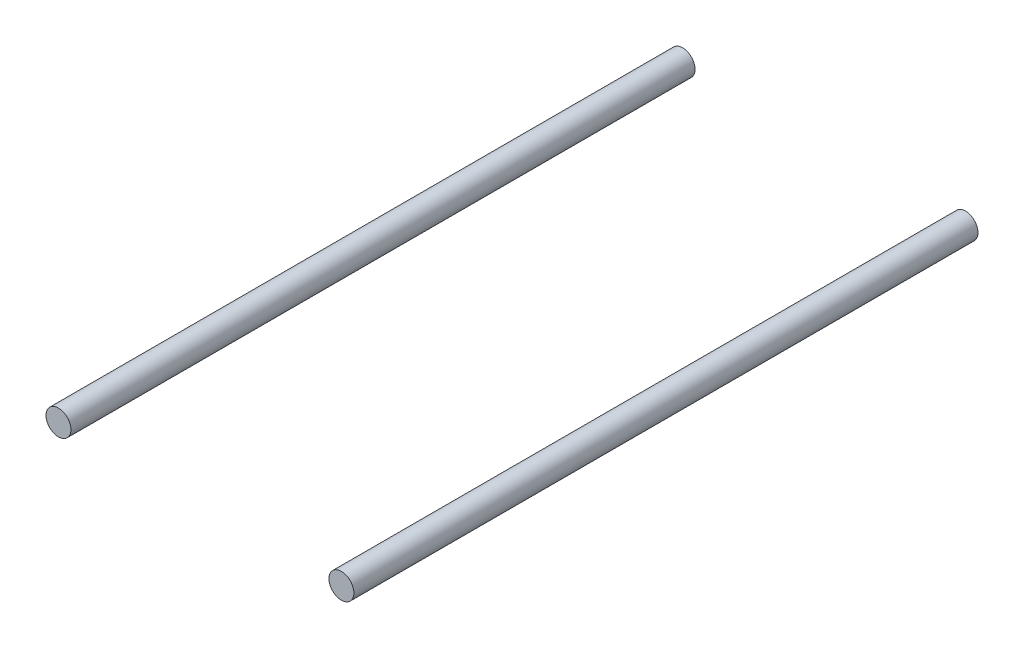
ISO-10303-21;
HEADER;
FILE_DESCRIPTION(('STEP AP214'),'2;1');
FILE_NAME('part.step','',(''),(''),'','','');
FILE_SCHEMA(('AUTOMOTIVE_DESIGN { 1 0 10303 214 1 1 1 1 }'));
ENDSEC;
DATA;
#1=APPLICATION_CONTEXT('core data for automotive mechanical design processes');
#2=APPLICATION_PROTOCOL_DEFINITION('international standard','automotive_design',2000,#1);
#3=PRODUCT_CONTEXT('',#1,'mechanical');
#4=PRODUCT('Part','Part','',(#3));
#5=PRODUCT_RELATED_PRODUCT_CATEGORY('part','',(#4));
#6=PRODUCT_DEFINITION_FORMATION('','',#4);
#7=PRODUCT_DEFINITION_CONTEXT('part definition',#1,'design');
#8=PRODUCT_DEFINITION('design','',#6,#7);
#9=PRODUCT_DEFINITION_SHAPE('','',#8);
#10=(LENGTH_UNIT() NAMED_UNIT(*) SI_UNIT(.MILLI.,.METRE.));
#11=(NAMED_UNIT(*) PLANE_ANGLE_UNIT() SI_UNIT($,.RADIAN.));
#12=(NAMED_UNIT(*) SI_UNIT($,.STERADIAN.) SOLID_ANGLE_UNIT());
#13=UNCERTAINTY_MEASURE_WITH_UNIT(LENGTH_MEASURE(1.E-05),#10,'distance_accuracy_value','');
#14=(GEOMETRIC_REPRESENTATION_CONTEXT(3) GLOBAL_UNCERTAINTY_ASSIGNED_CONTEXT((#13)) GLOBAL_UNIT_ASSIGNED_CONTEXT((#10,
#11,#12)) REPRESENTATION_CONTEXT('',''));
#15=CARTESIAN_POINT('',(0.,0.,0.));
#16=DIRECTION('',(0.,0.,1.));
#17=DIRECTION('',(1.,0.,0.));
#18=AXIS2_PLACEMENT_3D('',#15,#16,#17);
#19=CARTESIAN_POINT('',(42.,7.5,-65.));
#20=DIRECTION('',(0.,0.,1.));
#21=DIRECTION('',(1.,0.,0.));
#22=AXIS2_PLACEMENT_3D('',#19,#20,#21);
#23=CYLINDRICAL_SURFACE('',#22,1.5);
#24=CARTESIAN_POINT('',(42.,7.5,-65.));
#25=DIRECTION('',(0.,0.,1.));
#26=DIRECTION('',(1.,0.,0.));
#27=AXIS2_PLACEMENT_3D('',#24,#25,#26);
#28=CIRCLE('',#27,1.5);
#29=CARTESIAN_POINT('',(43.5,7.5,-65.));
#30=VERTEX_POINT('',#29);
#31=EDGE_CURVE('E11',#30,#30,#28,.T.);
#32=ORIENTED_EDGE('',*,*,#31,.T.);
#33=EDGE_LOOP('',(#32));
#34=FACE_BOUND('',#33,.T.);
#35=CARTESIAN_POINT('',(42.,7.5,10.));
#36=DIRECTION('',(0.,0.,1.));
#37=DIRECTION('',(1.,0.,0.));
#38=AXIS2_PLACEMENT_3D('',#35,#36,#37);
#39=CIRCLE('',#38,1.5);
#40=CARTESIAN_POINT('',(43.5,7.5,10.));
#41=VERTEX_POINT('',#40);
#42=EDGE_CURVE('E42',#41,#41,#39,.T.);
#43=ORIENTED_EDGE('',*,*,#42,.F.);
#44=EDGE_LOOP('',(#43));
#45=FACE_BOUND('',#44,.T.);
#46=ADVANCED_FACE('F36',(#34,#45),#23,.T.);
#47=CARTESIAN_POINT('',(42.,7.5,-65.));
#48=DIRECTION('',(0.,0.,1.));
#49=DIRECTION('',(1.,0.,0.));
#50=AXIS2_PLACEMENT_3D('',#47,#48,#49);
#51=PLANE('',#50);
#52=ORIENTED_EDGE('',*,*,#31,.F.);
#53=EDGE_LOOP('',(#52));
#54=FACE_BOUND('',#53,.T.);
#55=ADVANCED_FACE('F51',(#54),#51,.F.);
#56=CARTESIAN_POINT('',(42.,7.5,10.));
#57=DIRECTION('',(0.,0.,1.));
#58=DIRECTION('',(1.,0.,0.));
#59=AXIS2_PLACEMENT_3D('',#56,#57,#58);
#60=PLANE('',#59);
#61=ORIENTED_EDGE('',*,*,#42,.T.);
#62=EDGE_LOOP('',(#61));
#63=FACE_BOUND('',#62,.T.);
#64=ADVANCED_FACE('F48',(#63),#60,.T.);
#65=CLOSED_SHELL('',(#46,#55,#64));
#66=MANIFOLD_SOLID_BREP('B2',#65);
#67=CARTESIAN_POINT('',(8.,7.5,-65.));
#68=DIRECTION('',(0.,0.,1.));
#69=DIRECTION('',(1.,0.,0.));
#70=AXIS2_PLACEMENT_3D('',#67,#68,#69);
#71=CYLINDRICAL_SURFACE('',#70,1.5);
#72=CARTESIAN_POINT('',(8.,7.5,-65.));
#73=DIRECTION('',(0.,0.,1.));
#74=DIRECTION('',(1.,0.,0.));
#75=AXIS2_PLACEMENT_3D('',#72,#73,#74);
#76=CIRCLE('',#75,1.5);
#77=CARTESIAN_POINT('',(9.5,7.5,-65.));
#78=VERTEX_POINT('',#77);
#79=EDGE_CURVE('E35',#78,#78,#76,.T.);
#80=ORIENTED_EDGE('',*,*,#79,.T.);
#81=EDGE_LOOP('',(#80));
#82=FACE_BOUND('',#81,.T.);
#83=CARTESIAN_POINT('',(8.,7.5,10.));
#84=DIRECTION('',(0.,0.,1.));
#85=DIRECTION('',(1.,0.,0.));
#86=AXIS2_PLACEMENT_3D('',#83,#84,#85);
#87=CIRCLE('',#86,1.5);
#88=CARTESIAN_POINT('',(9.5,7.5,10.));
#89=VERTEX_POINT('',#88);
#90=EDGE_CURVE('E82',#89,#89,#87,.T.);
#91=ORIENTED_EDGE('',*,*,#90,.F.);
#92=EDGE_LOOP('',(#91));
#93=FACE_BOUND('',#92,.T.);
#94=ADVANCED_FACE('F76',(#82,#93),#71,.T.);
#95=CARTESIAN_POINT('',(8.,7.5,-65.));
#96=DIRECTION('',(0.,0.,1.));
#97=DIRECTION('',(1.,0.,0.));
#98=AXIS2_PLACEMENT_3D('',#95,#96,#97);
#99=PLANE('',#98);
#100=ORIENTED_EDGE('',*,*,#79,.F.);
#101=EDGE_LOOP('',(#100));
#102=FACE_BOUND('',#101,.T.);
#103=ADVANCED_FACE('F91',(#102),#99,.F.);
#104=CARTESIAN_POINT('',(8.,7.5,10.));
#105=DIRECTION('',(0.,0.,1.));
#106=DIRECTION('',(1.,0.,0.));
#107=AXIS2_PLACEMENT_3D('',#104,#105,#106);
#108=PLANE('',#107);
#109=ORIENTED_EDGE('',*,*,#90,.T.);
#110=EDGE_LOOP('',(#109));
#111=FACE_BOUND('',#110,.T.);
#112=ADVANCED_FACE('F88',(#111),#108,.T.);
#113=CLOSED_SHELL('',(#94,#103,#112));
#114=MANIFOLD_SOLID_BREP('B6',#113);
#115=ADVANCED_BREP_SHAPE_REPRESENTATION('',(#18,#66,#114),#14);
#116=SHAPE_DEFINITION_REPRESENTATION(#9,#115);
ENDSEC;
END-ISO-10303-21;
